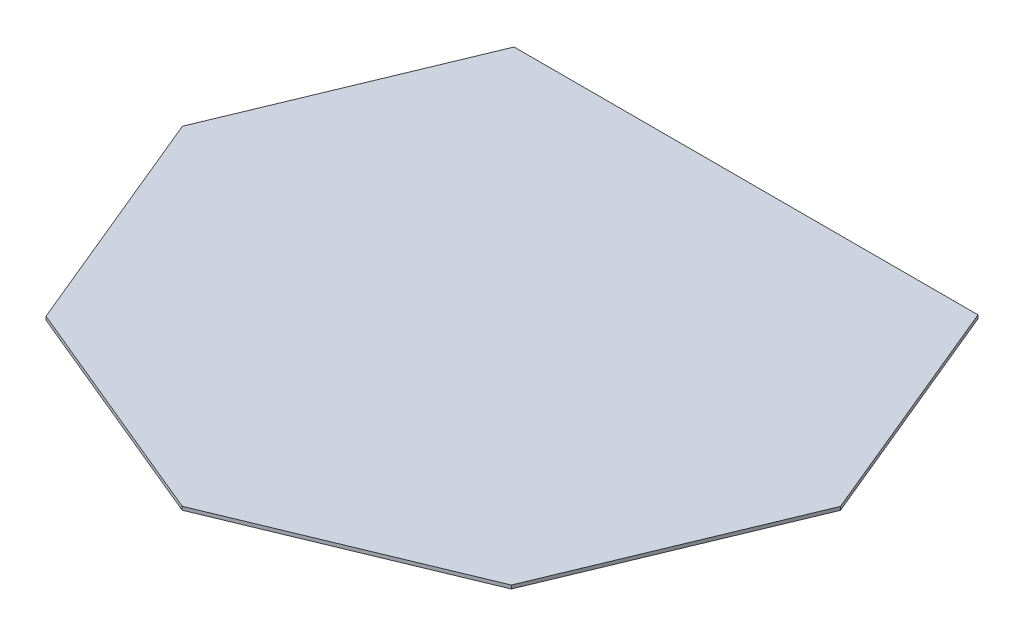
ISO-10303-21;
HEADER;
FILE_DESCRIPTION(('STEP AP214'),'2;1');
FILE_NAME('part.step','',(''),(''),'','','');
FILE_SCHEMA(('AUTOMOTIVE_DESIGN { 1 0 10303 214 1 1 1 1 }'));
ENDSEC;
DATA;
#1=APPLICATION_CONTEXT('core data for automotive mechanical design processes');
#2=APPLICATION_PROTOCOL_DEFINITION('international standard','automotive_design',2000,#1);
#3=PRODUCT_CONTEXT('',#1,'mechanical');
#4=PRODUCT('Part','Part','',(#3));
#5=PRODUCT_RELATED_PRODUCT_CATEGORY('part','',(#4));
#6=PRODUCT_DEFINITION_FORMATION('','',#4);
#7=PRODUCT_DEFINITION_CONTEXT('part definition',#1,'design');
#8=PRODUCT_DEFINITION('design','',#6,#7);
#9=PRODUCT_DEFINITION_SHAPE('','',#8);
#10=(LENGTH_UNIT() NAMED_UNIT(*) SI_UNIT(.MILLI.,.METRE.));
#11=(NAMED_UNIT(*) PLANE_ANGLE_UNIT() SI_UNIT($,.RADIAN.));
#12=(NAMED_UNIT(*) SI_UNIT($,.STERADIAN.) SOLID_ANGLE_UNIT());
#13=UNCERTAINTY_MEASURE_WITH_UNIT(LENGTH_MEASURE(1.E-05),#10,'distance_accuracy_value','');
#14=(GEOMETRIC_REPRESENTATION_CONTEXT(3) GLOBAL_UNCERTAINTY_ASSIGNED_CONTEXT((#13)) GLOBAL_UNIT_ASSIGNED_CONTEXT((#10,
#11,#12)) REPRESENTATION_CONTEXT('',''));
#15=CARTESIAN_POINT('',(0.,0.,0.));
#16=DIRECTION('',(0.,0.,1.));
#17=DIRECTION('',(1.,0.,0.));
#18=AXIS2_PLACEMENT_3D('',#15,#16,#17);
#19=CARTESIAN_POINT('',(-675.580964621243,10.,-683.27860786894));
#20=DIRECTION('',(0.923768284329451,0.,0.382951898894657));
#21=DIRECTION('',(0.382951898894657,0.,-0.923768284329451));
#22=AXIS2_PLACEMENT_3D('',#19,#20,#21);
#23=PLANE('',#22);
#24=DIRECTION('',(-0.382951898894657,0.,0.923768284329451));
#25=VECTOR('',#24,1.);
#26=CARTESIAN_POINT('',(-675.580964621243,0.,-683.27860786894));
#27=LINE('',#26,#25);
#28=CARTESIAN_POINT('',(-675.580964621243,0.,-683.27860786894));
#29=VERTEX_POINT('',#28);
#30=CARTESIAN_POINT('',(-958.72139213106,0.,-0.278607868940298));
#31=VERTEX_POINT('',#30);
#32=EDGE_CURVE('E122',#29,#31,#27,.T.);
#33=ORIENTED_EDGE('',*,*,#32,.T.);
#34=DIRECTION('',(0.,-1.,0.));
#35=VECTOR('',#34,1.);
#36=CARTESIAN_POINT('',(-958.72139213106,10.,-0.278607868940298));
#37=LINE('',#36,#35);
#38=CARTESIAN_POINT('',(-958.72139213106,10.,-0.278607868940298));
#39=VERTEX_POINT('',#38);
#40=EDGE_CURVE('E11',#39,#31,#37,.T.);
#41=ORIENTED_EDGE('',*,*,#40,.F.);
#42=DIRECTION('',(-0.382951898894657,0.,0.923768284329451));
#43=VECTOR('',#42,1.);
#44=CARTESIAN_POINT('',(-675.580964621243,10.,-683.27860786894));
#45=LINE('',#44,#43);
#46=CARTESIAN_POINT('',(-675.580964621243,10.,-683.27860786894));
#47=VERTEX_POINT('',#46);
#48=EDGE_CURVE('E134',#47,#39,#45,.T.);
#49=ORIENTED_EDGE('',*,*,#48,.F.);
#50=DIRECTION('',(0.,-1.,0.));
#51=VECTOR('',#50,1.);
#52=CARTESIAN_POINT('',(-675.580964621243,10.,-683.27860786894));
#53=LINE('',#52,#51);
#54=EDGE_CURVE('E118',#47,#29,#53,.T.);
#55=ORIENTED_EDGE('',*,*,#54,.T.);
#56=EDGE_LOOP('',(#33,#41,#49,#55));
#57=FACE_BOUND('',#56,.T.);
#58=ADVANCED_FACE('F32',(#57),#23,.F.);
#59=CARTESIAN_POINT('',(-958.72139213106,10.,-0.278607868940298));
#60=DIRECTION('',(0.923990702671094,0.,-0.38241493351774));
#61=DIRECTION('',(-0.38241493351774,0.,-0.923990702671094));
#62=AXIS2_PLACEMENT_3D('',#59,#60,#61);
#63=PLANE('',#62);
#64=DIRECTION('',(0.38241493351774,0.,0.923990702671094));
#65=VECTOR('',#64,1.);
#66=CARTESIAN_POINT('',(-958.72139213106,0.,-0.278607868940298));
#67=LINE('',#66,#65);
#68=CARTESIAN_POINT('',(-678.115403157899,0.,677.72139213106));
#69=VERTEX_POINT('',#68);
#70=EDGE_CURVE('E125',#31,#69,#67,.T.);
#71=ORIENTED_EDGE('',*,*,#70,.T.);
#72=DIRECTION('',(0.,-1.,0.));
#73=VECTOR('',#72,1.);
#74=CARTESIAN_POINT('',(-678.115403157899,10.,677.72139213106));
#75=LINE('',#74,#73);
#76=CARTESIAN_POINT('',(-678.115403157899,10.,677.72139213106));
#77=VERTEX_POINT('',#76);
#78=EDGE_CURVE('E40',#77,#69,#75,.T.);
#79=ORIENTED_EDGE('',*,*,#78,.F.);
#80=DIRECTION('',(0.38241493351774,0.,0.923990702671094));
#81=VECTOR('',#80,1.);
#82=CARTESIAN_POINT('',(-958.72139213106,10.,-0.278607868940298));
#83=LINE('',#82,#81);
#84=EDGE_CURVE('E88',#39,#77,#83,.T.);
#85=ORIENTED_EDGE('',*,*,#84,.F.);
#86=ORIENTED_EDGE('',*,*,#40,.T.);
#87=EDGE_LOOP('',(#71,#79,#85,#86));
#88=FACE_BOUND('',#87,.T.);
#89=ADVANCED_FACE('F159',(#88),#63,.F.);
#90=CARTESIAN_POINT('',(-678.115403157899,10.,677.72139213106));
#91=DIRECTION('',(0.382951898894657,0.,-0.92376828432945));
#92=DIRECTION('',(-0.92376828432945,0.,-0.382951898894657));
#93=AXIS2_PLACEMENT_3D('',#90,#91,#92);
#94=PLANE('',#93);
#95=DIRECTION('',(0.92376828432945,0.,0.382951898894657));
#96=VECTOR('',#95,1.);
#97=CARTESIAN_POINT('',(-678.115403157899,0.,677.72139213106));
#98=LINE('',#97,#96);
#99=CARTESIAN_POINT('',(-0.278607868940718,0.,958.72139213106));
#100=VERTEX_POINT('',#99);
#101=EDGE_CURVE('E127',#69,#100,#98,.T.);
#102=ORIENTED_EDGE('',*,*,#101,.T.);
#103=DIRECTION('',(0.,-1.,0.));
#104=VECTOR('',#103,1.);
#105=CARTESIAN_POINT('',(-0.278607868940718,10.,958.72139213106));
#106=LINE('',#105,#104);
#107=CARTESIAN_POINT('',(-0.278607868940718,10.,958.72139213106));
#108=VERTEX_POINT('',#107);
#109=EDGE_CURVE('E138',#108,#100,#106,.T.);
#110=ORIENTED_EDGE('',*,*,#109,.F.);
#111=DIRECTION('',(0.92376828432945,0.,0.382951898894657));
#112=VECTOR('',#111,1.);
#113=CARTESIAN_POINT('',(-678.115403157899,10.,677.72139213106));
#114=LINE('',#113,#112);
#115=EDGE_CURVE('E146',#77,#108,#114,.T.);
#116=ORIENTED_EDGE('',*,*,#115,.F.);
#117=ORIENTED_EDGE('',*,*,#78,.T.);
#118=EDGE_LOOP('',(#102,#110,#116,#117));
#119=FACE_BOUND('',#118,.T.);
#120=ADVANCED_FACE('F144',(#119),#94,.F.);
#121=CARTESIAN_POINT('',(-0.278607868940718,10.,958.72139213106));
#122=DIRECTION('',(-0.38241493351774,0.,-0.923990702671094));
#123=DIRECTION('',(-0.923990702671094,0.,0.38241493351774));
#124=AXIS2_PLACEMENT_3D('',#121,#122,#123);
#125=PLANE('',#124);
#126=DIRECTION('',(0.923990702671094,0.,-0.38241493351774));
#127=VECTOR('',#126,1.);
#128=CARTESIAN_POINT('',(-0.278607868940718,0.,958.72139213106));
#129=LINE('',#128,#127);
#130=CARTESIAN_POINT('',(677.721392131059,0.,678.1154031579));
#131=VERTEX_POINT('',#130);
#132=EDGE_CURVE('E129',#100,#131,#129,.T.);
#133=ORIENTED_EDGE('',*,*,#132,.T.);
#134=DIRECTION('',(0.,-1.,0.));
#135=VECTOR('',#134,1.);
#136=CARTESIAN_POINT('',(677.721392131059,10.,678.1154031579));
#137=LINE('',#136,#135);
#138=CARTESIAN_POINT('',(677.721392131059,10.,678.1154031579));
#139=VERTEX_POINT('',#138);
#140=EDGE_CURVE('E113',#139,#131,#137,.T.);
#141=ORIENTED_EDGE('',*,*,#140,.F.);
#142=DIRECTION('',(0.923990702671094,0.,-0.38241493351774));
#143=VECTOR('',#142,1.);
#144=CARTESIAN_POINT('',(-0.278607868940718,10.,958.72139213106));
#145=LINE('',#144,#143);
#146=EDGE_CURVE('E104',#108,#139,#145,.T.);
#147=ORIENTED_EDGE('',*,*,#146,.F.);
#148=ORIENTED_EDGE('',*,*,#109,.T.);
#149=EDGE_LOOP('',(#133,#141,#147,#148));
#150=FACE_BOUND('',#149,.T.);
#151=ADVANCED_FACE('F152',(#150),#125,.F.);
#152=CARTESIAN_POINT('',(677.721392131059,10.,678.1154031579));
#153=DIRECTION('',(-0.92376828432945,0.,-0.382951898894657));
#154=DIRECTION('',(-0.382951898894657,0.,0.92376828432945));
#155=AXIS2_PLACEMENT_3D('',#152,#153,#154);
#156=PLANE('',#155);
#157=DIRECTION('',(0.382951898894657,0.,-0.92376828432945));
#158=VECTOR('',#157,1.);
#159=CARTESIAN_POINT('',(677.721392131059,0.,678.1154031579));
#160=LINE('',#159,#158);
#161=CARTESIAN_POINT('',(958.72139213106,0.,0.278607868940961));
#162=VERTEX_POINT('',#161);
#163=EDGE_CURVE('E112',#131,#162,#160,.T.);
#164=ORIENTED_EDGE('',*,*,#163,.T.);
#165=DIRECTION('',(0.,-1.,0.));
#166=VECTOR('',#165,1.);
#167=CARTESIAN_POINT('',(958.72139213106,10.,0.278607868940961));
#168=LINE('',#167,#166);
#169=CARTESIAN_POINT('',(958.72139213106,10.,0.278607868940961));
#170=VERTEX_POINT('',#169);
#171=EDGE_CURVE('E109',#170,#162,#168,.T.);
#172=ORIENTED_EDGE('',*,*,#171,.F.);
#173=DIRECTION('',(0.382951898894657,0.,-0.92376828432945));
#174=VECTOR('',#173,1.);
#175=CARTESIAN_POINT('',(677.721392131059,10.,678.1154031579));
#176=LINE('',#175,#174);
#177=EDGE_CURVE('E98',#139,#170,#176,.T.);
#178=ORIENTED_EDGE('',*,*,#177,.F.);
#179=ORIENTED_EDGE('',*,*,#140,.T.);
#180=EDGE_LOOP('',(#164,#172,#178,#179));
#181=FACE_BOUND('',#180,.T.);
#182=ADVANCED_FACE('F110',(#181),#156,.F.);
#183=CARTESIAN_POINT('',(958.72139213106,10.,0.278607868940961));
#184=DIRECTION('',(-0.923990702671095,0.,0.38241493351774));
#185=DIRECTION('',(0.38241493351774,0.,0.923990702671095));
#186=AXIS2_PLACEMENT_3D('',#183,#184,#185);
#187=PLANE('',#186);
#188=DIRECTION('',(-0.38241493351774,0.,-0.923990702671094));
#189=VECTOR('',#188,1.);
#190=CARTESIAN_POINT('',(958.72139213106,0.,0.278607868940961));
#191=LINE('',#190,#189);
#192=CARTESIAN_POINT('',(675.81542083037,0.,-683.27860786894));
#193=VERTEX_POINT('',#192);
#194=EDGE_CURVE('E74',#162,#193,#191,.T.);
#195=ORIENTED_EDGE('',*,*,#194,.T.);
#196=DIRECTION('',(0.,-1.,0.));
#197=VECTOR('',#196,1.);
#198=CARTESIAN_POINT('',(675.81542083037,10.,-683.27860786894));
#199=LINE('',#198,#197);
#200=CARTESIAN_POINT('',(675.81542083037,10.,-683.27860786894));
#201=VERTEX_POINT('',#200);
#202=EDGE_CURVE('E114',#201,#193,#199,.T.);
#203=ORIENTED_EDGE('',*,*,#202,.F.);
#204=DIRECTION('',(-0.38241493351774,0.,-0.923990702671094));
#205=VECTOR('',#204,1.);
#206=CARTESIAN_POINT('',(958.72139213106,10.,0.278607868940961));
#207=LINE('',#206,#205);
#208=EDGE_CURVE('E102',#170,#201,#207,.T.);
#209=ORIENTED_EDGE('',*,*,#208,.F.);
#210=ORIENTED_EDGE('',*,*,#171,.T.);
#211=EDGE_LOOP('',(#195,#203,#209,#210));
#212=FACE_BOUND('',#211,.T.);
#213=ADVANCED_FACE('F116',(#212),#187,.F.);
#214=CARTESIAN_POINT('',(-675.580964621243,10.,-683.27860786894));
#215=DIRECTION('',(0.,0.,1.));
#216=DIRECTION('',(1.,0.,0.));
#217=AXIS2_PLACEMENT_3D('',#214,#215,#216);
#218=PLANE('',#217);
#219=DIRECTION('',(-1.,0.,0.));
#220=VECTOR('',#219,1.);
#221=CARTESIAN_POINT('',(-675.580964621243,0.,-683.27860786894));
#222=LINE('',#221,#220);
#223=EDGE_CURVE('E80',#193,#29,#222,.T.);
#224=ORIENTED_EDGE('',*,*,#223,.T.);
#225=ORIENTED_EDGE('',*,*,#54,.F.);
#226=DIRECTION('',(-1.,0.,0.));
#227=VECTOR('',#226,1.);
#228=CARTESIAN_POINT('',(-675.580964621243,10.,-683.27860786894));
#229=LINE('',#228,#227);
#230=EDGE_CURVE('E48',#201,#47,#229,.T.);
#231=ORIENTED_EDGE('',*,*,#230,.F.);
#232=ORIENTED_EDGE('',*,*,#202,.T.);
#233=EDGE_LOOP('',(#224,#225,#231,#232));
#234=FACE_BOUND('',#233,.T.);
#235=ADVANCED_FACE('F173',(#234),#218,.F.);
#236=CARTESIAN_POINT('',(-1157.41839764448,10.,479.02438661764));
#237=DIRECTION('',(0.,1.,0.));
#238=DIRECTION('',(0.,0.,1.));
#239=AXIS2_PLACEMENT_3D('',#236,#237,#238);
#240=PLANE('',#239);
#241=ORIENTED_EDGE('',*,*,#48,.T.);
#242=ORIENTED_EDGE('',*,*,#84,.T.);
#243=ORIENTED_EDGE('',*,*,#115,.T.);
#244=ORIENTED_EDGE('',*,*,#146,.T.);
#245=ORIENTED_EDGE('',*,*,#177,.T.);
#246=ORIENTED_EDGE('',*,*,#208,.T.);
#247=ORIENTED_EDGE('',*,*,#230,.T.);
#248=EDGE_LOOP('',(#241,#242,#243,#244,#245,#246,#247));
#249=FACE_BOUND('',#248,.T.);
#250=ADVANCED_FACE('F100',(#249),#240,.T.);
#251=CARTESIAN_POINT('',(-1157.41839764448,0.,479.02438661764));
#252=DIRECTION('',(0.,1.,0.));
#253=DIRECTION('',(0.,0.,1.));
#254=AXIS2_PLACEMENT_3D('',#251,#252,#253);
#255=PLANE('',#254);
#256=ORIENTED_EDGE('',*,*,#32,.F.);
#257=ORIENTED_EDGE('',*,*,#223,.F.);
#258=ORIENTED_EDGE('',*,*,#194,.F.);
#259=ORIENTED_EDGE('',*,*,#163,.F.);
#260=ORIENTED_EDGE('',*,*,#132,.F.);
#261=ORIENTED_EDGE('',*,*,#101,.F.);
#262=ORIENTED_EDGE('',*,*,#70,.F.);
#263=EDGE_LOOP('',(#256,#257,#258,#259,#260,#261,#262));
#264=FACE_BOUND('',#263,.T.);
#265=ADVANCED_FACE('F150',(#264),#255,.F.);
#266=CLOSED_SHELL('',(#58,#89,#120,#151,#182,#213,#235,#250,#265));
#267=MANIFOLD_SOLID_BREP('B2',#266);
#268=ADVANCED_BREP_SHAPE_REPRESENTATION('',(#18,#267),#14);
#269=SHAPE_DEFINITION_REPRESENTATION(#9,#268);
ENDSEC;
END-ISO-10303-21;
